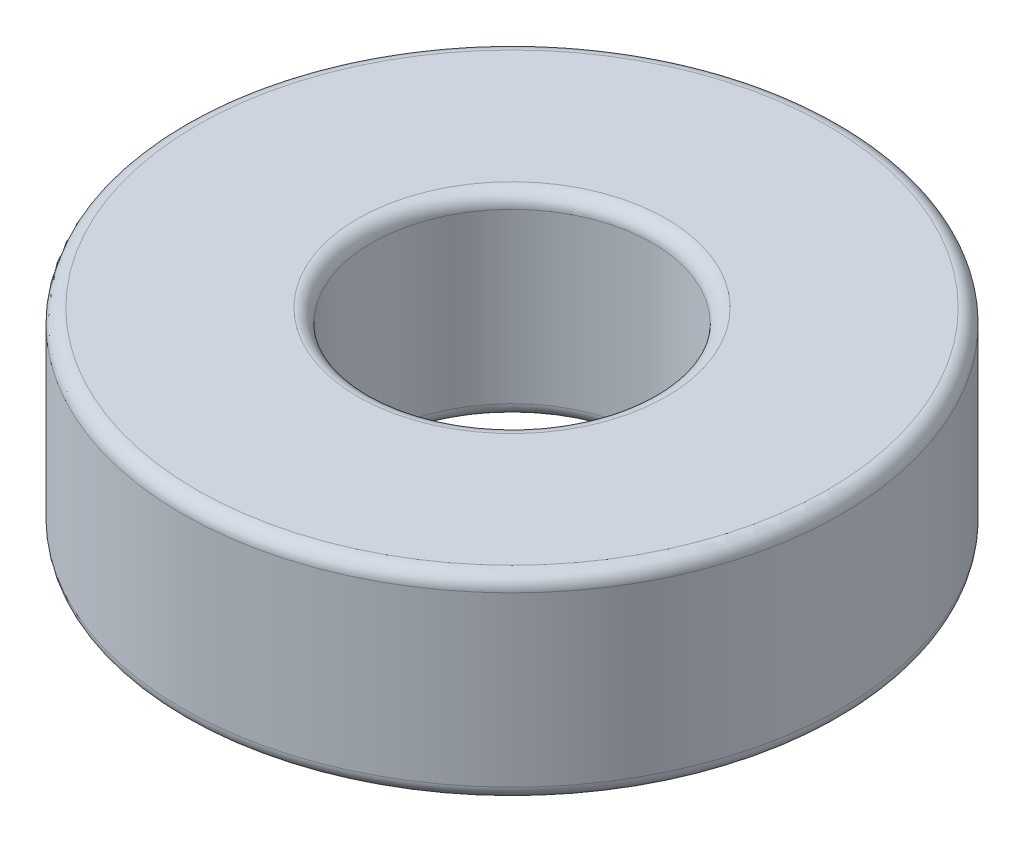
from build123d import *


with BuildPart() as part:
    # Esquisse1 → Base-R_volution (revolve)
    with BuildSketch(Plane.XY, mode=Mode.PRIVATE) as base_r_volution_sk:
        with BuildLine():
            Line((11, 0), (22.5, 0))
            ThreePointArc((22.5, 0), (23.207106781, 0.292893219), (23.5, 1))
            Line((23.5, 1), (23.5, 13))
            ThreePointArc((23.5, 13), (23.207106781, 13.707106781), (22.5, 14))
            Line((22.5, 14), (11, 14))
            ThreePointArc((11, 14), (10.292893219, 13.707106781), (10, 13))
            Line((10, 13), (10, 1))
            ThreePointArc((10, 1), (10.292893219, 0.292893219), (11, 0))
        make_face()
    revolve(base_r_volution_sk.sketch.rotate(Axis((0, 15.5125, 0), (0, -1, 0)), 90), axis=Axis((0, 15.5125, 0), (0, -1, 0)))


solid = part.part
